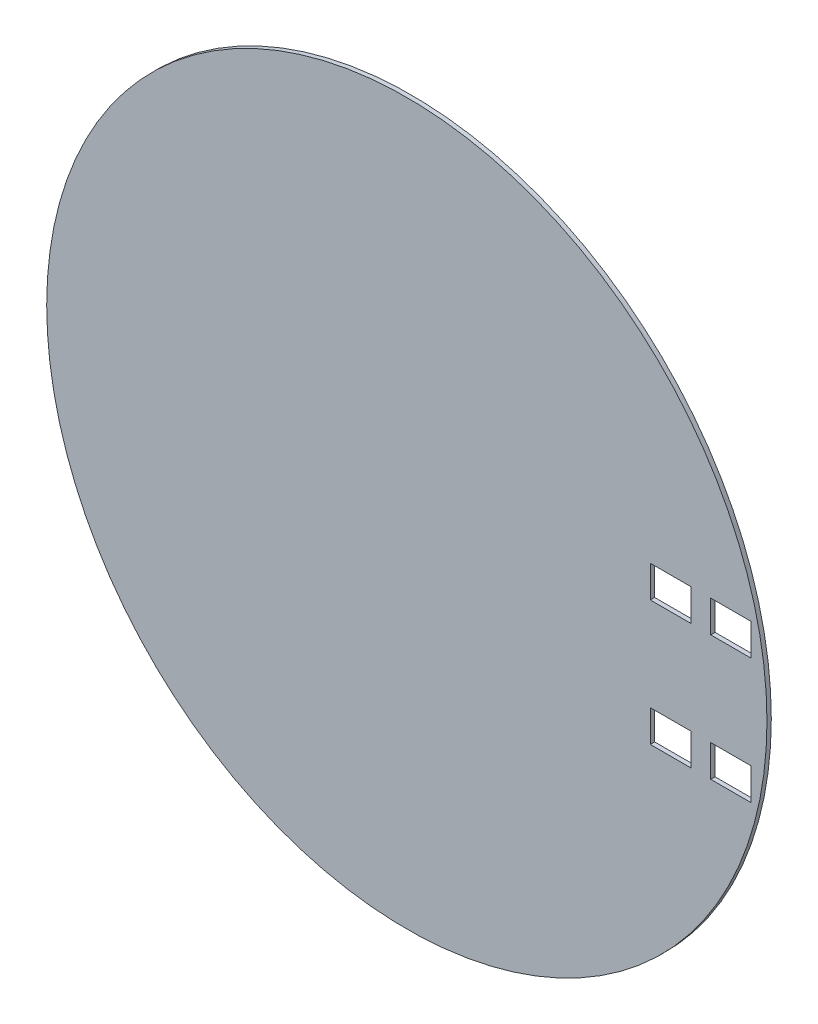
from build123d import *

# Parameters (mm, degrees)
REFERENCE_ONLY_DIE_CUT_FILM_WITH_ADHESIV_START = 1.5
REFERENCE_ONLY_DIE_CUT_FILM_WITH_ADH_2_R       = 24.9
REFERENCE_ONLY_DIE_CUT_FILM_WITH_ADHESIV_DEPTH = 0.3
USB_SH_RELIEF_18_232_4_3251_START              = 1.49
USB_SH_RELIEF_18_232_4_3251_SKETCH_W           = 2.8
USB_SH_RELIEF_18_232_4_3251_SKETCH_H           = 2.2
USB_SH_RELIEF_18_232_4_3251_DEPTH              = 0.32
USB_SH_RELIEF_18_232_4_3251_SKETCH_2_W         = 2.8
USB_SH_RELIEF_18_232_4_3251_SKETCH_2_H         = 2.2
USB_SH_RELIEF_18_232_4_3251_2_DEPTH            = 0.32
USB_SH_RELIEF_22_4118_4_3251_START             = 1.49
USB_SH_RELIEF_22_4118_4_3251_SKETCH_W          = 2.8
USB_SH_RELIEF_22_4118_4_3251_SKETCH_H          = 2.2
USB_SH_RELIEF_22_4118_4_3251_DEPTH             = 0.32
USB_SH_RELIEF_22_4118_4_3251_SKETCH_2_W        = 2.8
USB_SH_RELIEF_22_4118_4_3251_SKETCH_2_H        = 2.2
USB_SH_RELIEF_22_4118_4_3251_2_DEPTH           = 0.32


with BuildPart() as part:
    # Reference_only_die_cut_film_with_adh 2 → Reference_only_die_cut_film_with_adhesiv (new body)
    with BuildSketch(Plane.XY.offset(REFERENCE_ONLY_DIE_CUT_FILM_WITH_ADHESIV_START)):
        Circle(REFERENCE_ONLY_DIE_CUT_FILM_WITH_ADH_2_R)
    extrude(amount=REFERENCE_ONLY_DIE_CUT_FILM_WITH_ADHESIV_DEPTH)

    # USB_SH_relief_18.232_-4.3251_Sketch → USB_SH_relief_18.232_-4.3251 (cut)
    with BuildSketch(Plane.XY.offset(USB_SH_RELIEF_18_232_4_3251_START)):
        with Locations((18.232, -4.3251)):
            Rectangle(USB_SH_RELIEF_18_232_4_3251_SKETCH_W, USB_SH_RELIEF_18_232_4_3251_SKETCH_H)
    extrude(amount=USB_SH_RELIEF_18_232_4_3251_DEPTH, mode=Mode.SUBTRACT)

    # USB_SH_relief_18.232_4.3251_Sketch 2 → USB_SH_relief_18.232_4.3251 2 (cut)
    with BuildSketch(Plane.XY.offset(USB_SH_RELIEF_18_232_4_3251_START)):
        with Locations((18.232, 4.3251)):
            Rectangle(USB_SH_RELIEF_18_232_4_3251_SKETCH_2_W, USB_SH_RELIEF_18_232_4_3251_SKETCH_2_H)
    extrude(amount=USB_SH_RELIEF_18_232_4_3251_2_DEPTH, mode=Mode.SUBTRACT)

    # USB_SH_relief_22.4118_-4.3251_Sketch → USB_SH_relief_22.4118_-4.3251 (cut)
    with BuildSketch(Plane.XY.offset(USB_SH_RELIEF_22_4118_4_3251_START)):
        with Locations((22.4118, -4.3251)):
            Rectangle(USB_SH_RELIEF_22_4118_4_3251_SKETCH_W, USB_SH_RELIEF_22_4118_4_3251_SKETCH_H)
    extrude(amount=USB_SH_RELIEF_22_4118_4_3251_DEPTH, mode=Mode.SUBTRACT)

    # USB_SH_relief_22.4118_4.3251_Sketch 2 → USB_SH_relief_22.4118_4.3251 2 (cut)
    with BuildSketch(Plane.XY.offset(USB_SH_RELIEF_22_4118_4_3251_START)):
        with Locations((22.4118, 4.3251)):
            Rectangle(USB_SH_RELIEF_22_4118_4_3251_SKETCH_2_W, USB_SH_RELIEF_22_4118_4_3251_SKETCH_2_H)
    extrude(amount=USB_SH_RELIEF_22_4118_4_3251_2_DEPTH, mode=Mode.SUBTRACT)


solid = part.part
